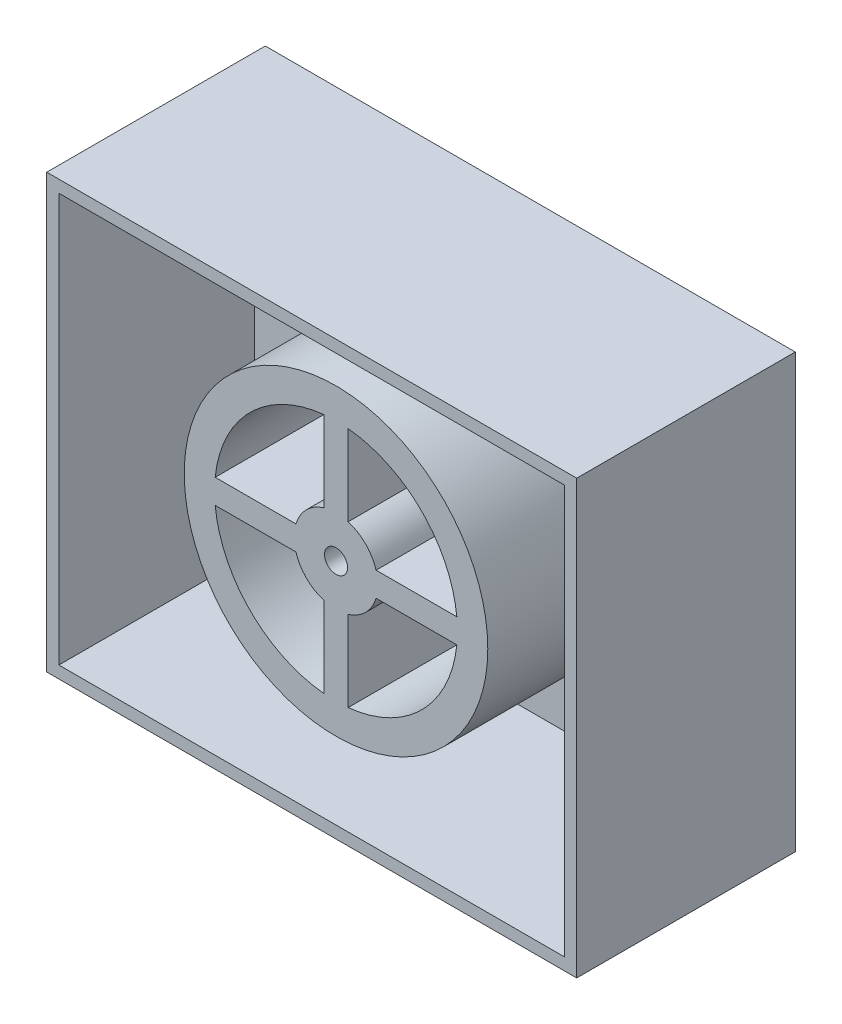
ISO-10303-21;
HEADER;
FILE_DESCRIPTION(('STEP AP214'),'2;1');
FILE_NAME('part.step','',(''),(''),'','','');
FILE_SCHEMA(('AUTOMOTIVE_DESIGN { 1 0 10303 214 1 1 1 1 }'));
ENDSEC;
DATA;
#1=APPLICATION_CONTEXT('core data for automotive mechanical design processes');
#2=APPLICATION_PROTOCOL_DEFINITION('international standard','automotive_design',2000,#1);
#3=PRODUCT_CONTEXT('',#1,'mechanical');
#4=PRODUCT('Part','Part','',(#3));
#5=PRODUCT_RELATED_PRODUCT_CATEGORY('part','',(#4));
#6=PRODUCT_DEFINITION_FORMATION('','',#4);
#7=PRODUCT_DEFINITION_CONTEXT('part definition',#1,'design');
#8=PRODUCT_DEFINITION('design','',#6,#7);
#9=PRODUCT_DEFINITION_SHAPE('','',#8);
#10=(LENGTH_UNIT() NAMED_UNIT(*) SI_UNIT(.MILLI.,.METRE.));
#11=(NAMED_UNIT(*) PLANE_ANGLE_UNIT() SI_UNIT($,.RADIAN.));
#12=(NAMED_UNIT(*) SI_UNIT($,.STERADIAN.) SOLID_ANGLE_UNIT());
#13=UNCERTAINTY_MEASURE_WITH_UNIT(LENGTH_MEASURE(1.E-05),#10,'distance_accuracy_value','');
#14=(GEOMETRIC_REPRESENTATION_CONTEXT(3) GLOBAL_UNCERTAINTY_ASSIGNED_CONTEXT((#13)) GLOBAL_UNIT_ASSIGNED_CONTEXT((#10,
#11,#12)) REPRESENTATION_CONTEXT('',''));
#15=CARTESIAN_POINT('',(0.,0.,0.));
#16=DIRECTION('',(0.,0.,1.));
#17=DIRECTION('',(1.,0.,0.));
#18=AXIS2_PLACEMENT_3D('',#15,#16,#17);
#19=CARTESIAN_POINT('',(0.,0.,0.));
#20=DIRECTION('',(0.,0.,1.));
#21=DIRECTION('',(1.,0.,0.));
#22=AXIS2_PLACEMENT_3D('',#19,#20,#21);
#23=PLANE('',#22);
#24=CARTESIAN_POINT('',(-10.1860016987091,5.21582887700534,0.));
#25=DIRECTION('',(0.,0.,1.));
#26=DIRECTION('',(1.,0.,0.));
#27=AXIS2_PLACEMENT_3D('',#24,#25,#26);
#28=CIRCLE('',#27,25.);
#29=CARTESIAN_POINT('',(14.8139983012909,5.21582887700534,0.));
#30=VERTEX_POINT('',#29);
#31=EDGE_CURVE('E62',#30,#30,#28,.T.);
#32=ORIENTED_EDGE('',*,*,#31,.F.);
#33=EDGE_LOOP('',(#32));
#34=FACE_BOUND('',#33,.T.);
#35=DIRECTION('',(-1.,0.,0.));
#36=VECTOR('',#35,1.);
#37=CARTESIAN_POINT('',(28.2619337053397,35.6684077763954,0.));
#38=LINE('',#37,#36);
#39=CARTESIAN_POINT('',(28.2619337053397,35.6684077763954,0.));
#40=VERTEX_POINT('',#39);
#41=CARTESIAN_POINT('',(-48.6339371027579,35.6684077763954,0.));
#42=VERTEX_POINT('',#41);
#43=EDGE_CURVE('E270',#40,#42,#38,.T.);
#44=ORIENTED_EDGE('',*,*,#43,.T.);
#45=DIRECTION('',(0.,-1.,0.));
#46=VECTOR('',#45,1.);
#47=CARTESIAN_POINT('',(-48.6339371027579,35.6684077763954,0.));
#48=LINE('',#47,#46);
#49=CARTESIAN_POINT('',(-48.6339371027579,-25.2367500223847,0.));
#50=VERTEX_POINT('',#49);
#51=EDGE_CURVE('E277',#42,#50,#48,.T.);
#52=ORIENTED_EDGE('',*,*,#51,.T.);
#53=DIRECTION('',(1.,0.,0.));
#54=VECTOR('',#53,1.);
#55=CARTESIAN_POINT('',(-48.6339371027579,-25.2367500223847,0.));
#56=LINE('',#55,#54);
#57=CARTESIAN_POINT('',(28.2619337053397,-25.2367500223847,0.));
#58=VERTEX_POINT('',#57);
#59=EDGE_CURVE('E250',#50,#58,#56,.T.);
#60=ORIENTED_EDGE('',*,*,#59,.T.);
#61=DIRECTION('',(0.,1.,0.));
#62=VECTOR('',#61,1.);
#63=CARTESIAN_POINT('',(28.2619337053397,-25.2367500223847,0.));
#64=LINE('',#63,#62);
#65=EDGE_CURVE('E74',#58,#40,#64,.T.);
#66=ORIENTED_EDGE('',*,*,#65,.T.);
#67=EDGE_LOOP('',(#44,#52,#60,#66));
#68=FACE_BOUND('',#67,.T.);
#69=ADVANCED_FACE('F58',(#34,#68),#23,.T.);
#70=CARTESIAN_POINT('',(-10.1860016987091,5.21582887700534,25.));
#71=DIRECTION('',(0.,0.,1.));
#72=DIRECTION('',(1.,0.,0.));
#73=AXIS2_PLACEMENT_3D('',#70,#71,#72);
#74=PLANE('',#73);
#75=CARTESIAN_POINT('',(-10.1860016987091,5.21582887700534,25.));
#76=DIRECTION('',(0.,0.,1.));
#77=DIRECTION('',(1.,0.,0.));
#78=AXIS2_PLACEMENT_3D('',#75,#76,#77);
#79=CIRCLE('',#78,25.);
#80=CARTESIAN_POINT('',(14.8139983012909,5.21582887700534,25.));
#81=VERTEX_POINT('',#80);
#82=EDGE_CURVE('E12',#81,#81,#79,.T.);
#83=ORIENTED_EDGE('',*,*,#82,.T.);
#84=EDGE_LOOP('',(#83));
#85=FACE_BOUND('',#84,.T.);
#86=CARTESIAN_POINT('',(-10.1860016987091,5.21582887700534,25.));
#87=DIRECTION('',(0.,0.,1.));
#88=DIRECTION('',(1.,0.,0.));
#89=AXIS2_PLACEMENT_3D('',#86,#87,#88);
#90=CIRCLE('',#89,1.9);
#91=CARTESIAN_POINT('',(-8.28600169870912,5.21582887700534,25.));
#92=VERTEX_POINT('',#91);
#93=EDGE_CURVE('E67',#92,#92,#90,.T.);
#94=ORIENTED_EDGE('',*,*,#93,.F.);
#95=EDGE_LOOP('',(#94));
#96=FACE_BOUND('',#95,.T.);
#97=DIRECTION('',(1.,0.,0.));
#98=VECTOR('',#97,1.);
#99=CARTESIAN_POINT('',(-3.5822149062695,7.21582887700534,25.));
#100=LINE('',#99,#98);
#101=CARTESIAN_POINT('',(-3.5822149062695,7.21582887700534,25.));
#102=VERTEX_POINT('',#101);
#103=CARTESIAN_POINT('',(9.71374704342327,7.21582887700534,25.));
#104=VERTEX_POINT('',#103);
#105=EDGE_CURVE('E437',#102,#104,#100,.T.);
#106=ORIENTED_EDGE('',*,*,#105,.F.);
#107=CARTESIAN_POINT('',(-10.1860016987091,5.21582887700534,25.));
#108=DIRECTION('',(0.,0.,-1.));
#109=DIRECTION('',(1.,0.,0.));
#110=AXIS2_PLACEMENT_3D('',#107,#108,#109);
#111=CIRCLE('',#110,6.9);
#112=CARTESIAN_POINT('',(-8.18600169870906,11.8196156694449,25.));
#113=VERTEX_POINT('',#112);
#114=EDGE_CURVE('E435',#113,#102,#111,.T.);
#115=ORIENTED_EDGE('',*,*,#114,.F.);
#116=DIRECTION('',(0.,-1.,0.));
#117=VECTOR('',#116,1.);
#118=CARTESIAN_POINT('',(-8.18600169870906,11.8196156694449,25.));
#119=LINE('',#118,#117);
#120=CARTESIAN_POINT('',(-8.18600169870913,25.1155776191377,25.));
#121=VERTEX_POINT('',#120);
#122=EDGE_CURVE('E443',#121,#113,#119,.T.);
#123=ORIENTED_EDGE('',*,*,#122,.F.);
#124=CARTESIAN_POINT('',(-10.1860016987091,5.21582887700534,25.));
#125=DIRECTION('',(0.,0.,1.));
#126=DIRECTION('',(1.,0.,0.));
#127=AXIS2_PLACEMENT_3D('',#124,#125,#126);
#128=CIRCLE('',#127,20.);
#129=EDGE_CURVE('E440',#104,#121,#128,.T.);
#130=ORIENTED_EDGE('',*,*,#129,.F.);
#131=EDGE_LOOP('',(#106,#115,#123,#130));
#132=FACE_BOUND('',#131,.T.);
#133=DIRECTION('',(0.,-1.,0.));
#134=VECTOR('',#133,1.);
#135=CARTESIAN_POINT('',(-8.18600169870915,-1.38795791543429,25.));
#136=LINE('',#135,#134);
#137=CARTESIAN_POINT('',(-8.18600169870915,-1.38795791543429,25.));
#138=VERTEX_POINT('',#137);
#139=CARTESIAN_POINT('',(-8.18600169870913,-14.6839198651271,25.));
#140=VERTEX_POINT('',#139);
#141=EDGE_CURVE('E407',#138,#140,#136,.T.);
#142=ORIENTED_EDGE('',*,*,#141,.F.);
#143=CARTESIAN_POINT('',(-10.1860016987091,5.21582887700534,25.));
#144=DIRECTION('',(0.,0.,-1.));
#145=DIRECTION('',(1.,0.,0.));
#146=AXIS2_PLACEMENT_3D('',#143,#144,#145);
#147=CIRCLE('',#146,6.9);
#148=CARTESIAN_POINT('',(-3.5822149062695,3.21582887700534,25.));
#149=VERTEX_POINT('',#148);
#150=EDGE_CURVE('E405',#149,#138,#147,.T.);
#151=ORIENTED_EDGE('',*,*,#150,.F.);
#152=DIRECTION('',(-1.,0.,0.));
#153=VECTOR('',#152,1.);
#154=CARTESIAN_POINT('',(-3.5822149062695,3.21582887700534,25.));
#155=LINE('',#154,#153);
#156=CARTESIAN_POINT('',(9.71374704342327,3.21582887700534,25.));
#157=VERTEX_POINT('',#156);
#158=EDGE_CURVE('E413',#157,#149,#155,.T.);
#159=ORIENTED_EDGE('',*,*,#158,.F.);
#160=CARTESIAN_POINT('',(-10.1860016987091,5.21582887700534,25.));
#161=DIRECTION('',(0.,0.,1.));
#162=DIRECTION('',(1.,0.,0.));
#163=AXIS2_PLACEMENT_3D('',#160,#161,#162);
#164=CIRCLE('',#163,20.);
#165=EDGE_CURVE('E410',#140,#157,#164,.T.);
#166=ORIENTED_EDGE('',*,*,#165,.F.);
#167=EDGE_LOOP('',(#142,#151,#159,#166));
#168=FACE_BOUND('',#167,.T.);
#169=DIRECTION('',(-1.,0.,0.));
#170=VECTOR('',#169,1.);
#171=CARTESIAN_POINT('',(-16.7897884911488,3.21582887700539,25.));
#172=LINE('',#171,#170);
#173=CARTESIAN_POINT('',(-16.7897884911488,3.21582887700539,25.));
#174=VERTEX_POINT('',#173);
#175=CARTESIAN_POINT('',(-30.0857504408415,3.21582887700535,25.));
#176=VERTEX_POINT('',#175);
#177=EDGE_CURVE('E377',#174,#176,#172,.T.);
#178=ORIENTED_EDGE('',*,*,#177,.F.);
#179=CARTESIAN_POINT('',(-10.1860016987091,5.21582887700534,25.));
#180=DIRECTION('',(0.,0.,-1.));
#181=DIRECTION('',(1.,0.,0.));
#182=AXIS2_PLACEMENT_3D('',#179,#180,#181);
#183=CIRCLE('',#182,6.9);
#184=CARTESIAN_POINT('',(-12.1860016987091,-1.38795791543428,25.));
#185=VERTEX_POINT('',#184);
#186=EDGE_CURVE('E375',#185,#174,#183,.T.);
#187=ORIENTED_EDGE('',*,*,#186,.F.);
#188=DIRECTION('',(0.,1.,0.));
#189=VECTOR('',#188,1.);
#190=CARTESIAN_POINT('',(-12.1860016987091,-1.38795791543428,25.));
#191=LINE('',#190,#189);
#192=CARTESIAN_POINT('',(-12.1860016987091,-14.6839198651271,25.));
#193=VERTEX_POINT('',#192);
#194=EDGE_CURVE('E383',#193,#185,#191,.T.);
#195=ORIENTED_EDGE('',*,*,#194,.F.);
#196=CARTESIAN_POINT('',(-10.1860016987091,5.21582887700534,25.));
#197=DIRECTION('',(0.,0.,1.));
#198=DIRECTION('',(1.,0.,0.));
#199=AXIS2_PLACEMENT_3D('',#196,#197,#198);
#200=CIRCLE('',#199,20.);
#201=EDGE_CURVE('E380',#176,#193,#200,.T.);
#202=ORIENTED_EDGE('',*,*,#201,.F.);
#203=EDGE_LOOP('',(#178,#187,#195,#202));
#204=FACE_BOUND('',#203,.T.);
#205=DIRECTION('',(0.,1.,0.));
#206=VECTOR('',#205,1.);
#207=CARTESIAN_POINT('',(-12.1860016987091,11.819615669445,25.));
#208=LINE('',#207,#206);
#209=CARTESIAN_POINT('',(-12.1860016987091,11.819615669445,25.));
#210=VERTEX_POINT('',#209);
#211=CARTESIAN_POINT('',(-12.1860016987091,25.1155776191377,25.));
#212=VERTEX_POINT('',#211);
#213=EDGE_CURVE('E348',#210,#212,#208,.T.);
#214=ORIENTED_EDGE('',*,*,#213,.F.);
#215=CARTESIAN_POINT('',(-10.1860016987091,5.21582887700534,25.));
#216=DIRECTION('',(0.,0.,-1.));
#217=DIRECTION('',(1.,0.,0.));
#218=AXIS2_PLACEMENT_3D('',#215,#216,#217);
#219=CIRCLE('',#218,6.9);
#220=CARTESIAN_POINT('',(-16.7897884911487,7.21582887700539,25.));
#221=VERTEX_POINT('',#220);
#222=EDGE_CURVE('E346',#221,#210,#219,.T.);
#223=ORIENTED_EDGE('',*,*,#222,.F.);
#224=DIRECTION('',(1.,0.,0.));
#225=VECTOR('',#224,1.);
#226=CARTESIAN_POINT('',(-16.7897884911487,7.21582887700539,25.));
#227=LINE('',#226,#225);
#228=CARTESIAN_POINT('',(-30.0857504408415,7.21582887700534,25.));
#229=VERTEX_POINT('',#228);
#230=EDGE_CURVE('E353',#229,#221,#227,.T.);
#231=ORIENTED_EDGE('',*,*,#230,.F.);
#232=CARTESIAN_POINT('',(-10.1860016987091,5.21582887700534,25.));
#233=DIRECTION('',(0.,0.,1.));
#234=DIRECTION('',(1.,0.,0.));
#235=AXIS2_PLACEMENT_3D('',#232,#233,#234);
#236=CIRCLE('',#235,20.);
#237=EDGE_CURVE('E351',#212,#229,#236,.T.);
#238=ORIENTED_EDGE('',*,*,#237,.F.);
#239=EDGE_LOOP('',(#214,#223,#231,#238));
#240=FACE_BOUND('',#239,.T.);
#241=ADVANCED_FACE('F484',(#85,#96,#132,#168,#204,#240),#74,.T.);
#242=CARTESIAN_POINT('',(-10.1860016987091,5.21582887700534,25.));
#243=DIRECTION('',(0.,0.,-1.));
#244=DIRECTION('',(-1.,0.,0.));
#245=AXIS2_PLACEMENT_3D('',#242,#243,#244);
#246=CYLINDRICAL_SURFACE('',#245,25.);
#247=ORIENTED_EDGE('',*,*,#82,.F.);
#248=EDGE_LOOP('',(#247));
#249=FACE_BOUND('',#248,.T.);
#250=ORIENTED_EDGE('',*,*,#31,.T.);
#251=EDGE_LOOP('',(#250));
#252=FACE_BOUND('',#251,.T.);
#253=ADVANCED_FACE('F60',(#249,#252),#246,.T.);
#254=CARTESIAN_POINT('',(-10.1860016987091,5.21582887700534,25.));
#255=DIRECTION('',(0.,0.,-1.));
#256=DIRECTION('',(-1.,0.,0.));
#257=AXIS2_PLACEMENT_3D('',#254,#255,#256);
#258=CYLINDRICAL_SURFACE('',#257,1.9);
#259=ORIENTED_EDGE('',*,*,#93,.T.);
#260=EDGE_LOOP('',(#259));
#261=FACE_BOUND('',#260,.T.);
#262=CARTESIAN_POINT('',(-10.1860016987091,5.21582887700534,0.));
#263=DIRECTION('',(0.,0.,1.));
#264=DIRECTION('',(1.,0.,0.));
#265=AXIS2_PLACEMENT_3D('',#262,#263,#264);
#266=CIRCLE('',#265,1.9);
#267=CARTESIAN_POINT('',(-8.28600169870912,5.21582887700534,0.));
#268=VERTEX_POINT('',#267);
#269=EDGE_CURVE('E464',#268,#268,#266,.T.);
#270=ORIENTED_EDGE('',*,*,#269,.F.);
#271=EDGE_LOOP('',(#270));
#272=FACE_BOUND('',#271,.T.);
#273=ADVANCED_FACE('F472',(#261,#272),#258,.F.);
#274=CARTESIAN_POINT('',(-10.1860016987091,5.21582887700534,25.));
#275=DIRECTION('',(0.,0.,-1.));
#276=DIRECTION('',(-1.,0.,0.));
#277=AXIS2_PLACEMENT_3D('',#274,#275,#276);
#278=CYLINDRICAL_SURFACE('',#277,6.9);
#279=CARTESIAN_POINT('',(-10.1860016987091,5.21582887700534,0.));
#280=DIRECTION('',(0.,0.,-1.));
#281=DIRECTION('',(1.,0.,0.));
#282=AXIS2_PLACEMENT_3D('',#279,#280,#281);
#283=CIRCLE('',#282,6.9);
#284=CARTESIAN_POINT('',(-8.18600169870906,11.8196156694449,0.));
#285=VERTEX_POINT('',#284);
#286=CARTESIAN_POINT('',(-3.5822149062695,7.21582887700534,0.));
#287=VERTEX_POINT('',#286);
#288=EDGE_CURVE('E434',#285,#287,#283,.T.);
#289=ORIENTED_EDGE('',*,*,#288,.F.);
#290=DIRECTION('',(0.,0.,-1.));
#291=VECTOR('',#290,1.);
#292=CARTESIAN_POINT('',(-8.18600169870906,11.8196156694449,25.));
#293=LINE('',#292,#291);
#294=EDGE_CURVE('E445',#113,#285,#293,.T.);
#295=ORIENTED_EDGE('',*,*,#294,.F.);
#296=ORIENTED_EDGE('',*,*,#114,.T.);
#297=DIRECTION('',(0.,0.,-1.));
#298=VECTOR('',#297,1.);
#299=CARTESIAN_POINT('',(-3.5822149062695,7.21582887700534,25.));
#300=LINE('',#299,#298);
#301=EDGE_CURVE('E461',#102,#287,#300,.T.);
#302=ORIENTED_EDGE('',*,*,#301,.T.);
#303=EDGE_LOOP('',(#289,#295,#296,#302));
#304=FACE_BOUND('',#303,.T.);
#305=ADVANCED_FACE('F474',(#304),#278,.T.);
#306=CARTESIAN_POINT('',(-3.5822149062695,7.21582887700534,25.));
#307=DIRECTION('',(0.,1.,0.));
#308=DIRECTION('',(0.,0.,1.));
#309=AXIS2_PLACEMENT_3D('',#306,#307,#308);
#310=PLANE('',#309);
#311=DIRECTION('',(1.,0.,0.));
#312=VECTOR('',#311,1.);
#313=CARTESIAN_POINT('',(-3.5822149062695,7.21582887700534,0.));
#314=LINE('',#313,#312);
#315=CARTESIAN_POINT('',(9.71374704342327,7.21582887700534,0.));
#316=VERTEX_POINT('',#315);
#317=EDGE_CURVE('E448',#287,#316,#314,.T.);
#318=ORIENTED_EDGE('',*,*,#317,.F.);
#319=ORIENTED_EDGE('',*,*,#301,.F.);
#320=ORIENTED_EDGE('',*,*,#105,.T.);
#321=DIRECTION('',(0.,0.,-1.));
#322=VECTOR('',#321,1.);
#323=CARTESIAN_POINT('',(9.71374704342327,7.21582887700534,25.));
#324=LINE('',#323,#322);
#325=EDGE_CURVE('E459',#104,#316,#324,.T.);
#326=ORIENTED_EDGE('',*,*,#325,.T.);
#327=EDGE_LOOP('',(#318,#319,#320,#326));
#328=FACE_BOUND('',#327,.T.);
#329=ADVANCED_FACE('F481',(#328),#310,.T.);
#330=CARTESIAN_POINT('',(-10.1860016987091,5.21582887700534,25.));
#331=DIRECTION('',(0.,0.,-1.));
#332=DIRECTION('',(-1.,0.,0.));
#333=AXIS2_PLACEMENT_3D('',#330,#331,#332);
#334=CYLINDRICAL_SURFACE('',#333,20.);
#335=CARTESIAN_POINT('',(-10.1860016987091,5.21582887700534,0.));
#336=DIRECTION('',(0.,0.,1.));
#337=DIRECTION('',(1.,0.,0.));
#338=AXIS2_PLACEMENT_3D('',#335,#336,#337);
#339=CIRCLE('',#338,20.);
#340=CARTESIAN_POINT('',(-8.18600169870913,25.1155776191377,0.));
#341=VERTEX_POINT('',#340);
#342=EDGE_CURVE('E451',#316,#341,#339,.T.);
#343=ORIENTED_EDGE('',*,*,#342,.F.);
#344=ORIENTED_EDGE('',*,*,#325,.F.);
#345=ORIENTED_EDGE('',*,*,#129,.T.);
#346=DIRECTION('',(0.,0.,-1.));
#347=VECTOR('',#346,1.);
#348=CARTESIAN_POINT('',(-8.18600169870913,25.1155776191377,25.));
#349=LINE('',#348,#347);
#350=EDGE_CURVE('E457',#121,#341,#349,.T.);
#351=ORIENTED_EDGE('',*,*,#350,.T.);
#352=EDGE_LOOP('',(#343,#344,#345,#351));
#353=FACE_BOUND('',#352,.T.);
#354=ADVANCED_FACE('F573',(#353),#334,.F.);
#355=CARTESIAN_POINT('',(-8.18600169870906,11.8196156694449,25.));
#356=DIRECTION('',(1.,0.,0.));
#357=DIRECTION('',(0.,1.,0.));
#358=AXIS2_PLACEMENT_3D('',#355,#356,#357);
#359=PLANE('',#358);
#360=DIRECTION('',(0.,-1.,0.));
#361=VECTOR('',#360,1.);
#362=CARTESIAN_POINT('',(-8.18600169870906,11.8196156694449,0.));
#363=LINE('',#362,#361);
#364=EDGE_CURVE('E438',#341,#285,#363,.T.);
#365=ORIENTED_EDGE('',*,*,#364,.F.);
#366=ORIENTED_EDGE('',*,*,#350,.F.);
#367=ORIENTED_EDGE('',*,*,#122,.T.);
#368=ORIENTED_EDGE('',*,*,#294,.T.);
#369=EDGE_LOOP('',(#365,#366,#367,#368));
#370=FACE_BOUND('',#369,.T.);
#371=ADVANCED_FACE('F569',(#370),#359,.T.);
#372=CARTESIAN_POINT('',(-10.1860016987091,5.21582887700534,25.));
#373=DIRECTION('',(0.,0.,-1.));
#374=DIRECTION('',(-1.,0.,0.));
#375=AXIS2_PLACEMENT_3D('',#372,#373,#374);
#376=CYLINDRICAL_SURFACE('',#375,6.9);
#377=CARTESIAN_POINT('',(-10.1860016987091,5.21582887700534,0.));
#378=DIRECTION('',(0.,0.,-1.));
#379=DIRECTION('',(1.,0.,0.));
#380=AXIS2_PLACEMENT_3D('',#377,#378,#379);
#381=CIRCLE('',#380,6.9);
#382=CARTESIAN_POINT('',(-3.5822149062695,3.21582887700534,0.));
#383=VERTEX_POINT('',#382);
#384=CARTESIAN_POINT('',(-8.18600169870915,-1.38795791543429,0.));
#385=VERTEX_POINT('',#384);
#386=EDGE_CURVE('E404',#383,#385,#381,.T.);
#387=ORIENTED_EDGE('',*,*,#386,.F.);
#388=DIRECTION('',(0.,0.,-1.));
#389=VECTOR('',#388,1.);
#390=CARTESIAN_POINT('',(-3.5822149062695,3.21582887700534,25.));
#391=LINE('',#390,#389);
#392=EDGE_CURVE('E415',#149,#383,#391,.T.);
#393=ORIENTED_EDGE('',*,*,#392,.F.);
#394=ORIENTED_EDGE('',*,*,#150,.T.);
#395=DIRECTION('',(0.,0.,-1.));
#396=VECTOR('',#395,1.);
#397=CARTESIAN_POINT('',(-8.18600169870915,-1.38795791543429,25.));
#398=LINE('',#397,#396);
#399=EDGE_CURVE('E431',#138,#385,#398,.T.);
#400=ORIENTED_EDGE('',*,*,#399,.T.);
#401=EDGE_LOOP('',(#387,#393,#394,#400));
#402=FACE_BOUND('',#401,.T.);
#403=ADVANCED_FACE('F565',(#402),#376,.T.);
#404=CARTESIAN_POINT('',(-8.18600169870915,-1.38795791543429,25.));
#405=DIRECTION('',(1.,0.,0.));
#406=DIRECTION('',(0.,1.,0.));
#407=AXIS2_PLACEMENT_3D('',#404,#405,#406);
#408=PLANE('',#407);
#409=DIRECTION('',(0.,-1.,0.));
#410=VECTOR('',#409,1.);
#411=CARTESIAN_POINT('',(-8.18600169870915,-1.38795791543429,0.));
#412=LINE('',#411,#410);
#413=CARTESIAN_POINT('',(-8.18600169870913,-14.6839198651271,0.));
#414=VERTEX_POINT('',#413);
#415=EDGE_CURVE('E418',#385,#414,#412,.T.);
#416=ORIENTED_EDGE('',*,*,#415,.F.);
#417=ORIENTED_EDGE('',*,*,#399,.F.);
#418=ORIENTED_EDGE('',*,*,#141,.T.);
#419=DIRECTION('',(0.,0.,-1.));
#420=VECTOR('',#419,1.);
#421=CARTESIAN_POINT('',(-8.18600169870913,-14.6839198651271,25.));
#422=LINE('',#421,#420);
#423=EDGE_CURVE('E429',#140,#414,#422,.T.);
#424=ORIENTED_EDGE('',*,*,#423,.T.);
#425=EDGE_LOOP('',(#416,#417,#418,#424));
#426=FACE_BOUND('',#425,.T.);
#427=ADVANCED_FACE('F561',(#426),#408,.T.);
#428=CARTESIAN_POINT('',(-10.1860016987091,5.21582887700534,25.));
#429=DIRECTION('',(0.,0.,-1.));
#430=DIRECTION('',(-1.,0.,0.));
#431=AXIS2_PLACEMENT_3D('',#428,#429,#430);
#432=CYLINDRICAL_SURFACE('',#431,20.);
#433=CARTESIAN_POINT('',(-10.1860016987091,5.21582887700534,0.));
#434=DIRECTION('',(0.,0.,1.));
#435=DIRECTION('',(1.,0.,0.));
#436=AXIS2_PLACEMENT_3D('',#433,#434,#435);
#437=CIRCLE('',#436,20.);
#438=CARTESIAN_POINT('',(9.71374704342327,3.21582887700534,0.));
#439=VERTEX_POINT('',#438);
#440=EDGE_CURVE('E421',#414,#439,#437,.T.);
#441=ORIENTED_EDGE('',*,*,#440,.F.);
#442=ORIENTED_EDGE('',*,*,#423,.F.);
#443=ORIENTED_EDGE('',*,*,#165,.T.);
#444=DIRECTION('',(0.,0.,-1.));
#445=VECTOR('',#444,1.);
#446=CARTESIAN_POINT('',(9.71374704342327,3.21582887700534,25.));
#447=LINE('',#446,#445);
#448=EDGE_CURVE('E427',#157,#439,#447,.T.);
#449=ORIENTED_EDGE('',*,*,#448,.T.);
#450=EDGE_LOOP('',(#441,#442,#443,#449));
#451=FACE_BOUND('',#450,.T.);
#452=ADVANCED_FACE('F557',(#451),#432,.F.);
#453=CARTESIAN_POINT('',(-3.5822149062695,3.21582887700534,25.));
#454=DIRECTION('',(0.,-1.,0.));
#455=DIRECTION('',(0.,0.,-1.));
#456=AXIS2_PLACEMENT_3D('',#453,#454,#455);
#457=PLANE('',#456);
#458=DIRECTION('',(-1.,0.,0.));
#459=VECTOR('',#458,1.);
#460=CARTESIAN_POINT('',(-3.5822149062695,3.21582887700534,0.));
#461=LINE('',#460,#459);
#462=EDGE_CURVE('E408',#439,#383,#461,.T.);
#463=ORIENTED_EDGE('',*,*,#462,.F.);
#464=ORIENTED_EDGE('',*,*,#448,.F.);
#465=ORIENTED_EDGE('',*,*,#158,.T.);
#466=ORIENTED_EDGE('',*,*,#392,.T.);
#467=EDGE_LOOP('',(#463,#464,#465,#466));
#468=FACE_BOUND('',#467,.T.);
#469=ADVANCED_FACE('F553',(#468),#457,.T.);
#470=CARTESIAN_POINT('',(-10.1860016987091,5.21582887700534,25.));
#471=DIRECTION('',(0.,0.,-1.));
#472=DIRECTION('',(-1.,0.,0.));
#473=AXIS2_PLACEMENT_3D('',#470,#471,#472);
#474=CYLINDRICAL_SURFACE('',#473,6.9);
#475=CARTESIAN_POINT('',(-10.1860016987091,5.21582887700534,0.));
#476=DIRECTION('',(0.,0.,-1.));
#477=DIRECTION('',(1.,0.,0.));
#478=AXIS2_PLACEMENT_3D('',#475,#476,#477);
#479=CIRCLE('',#478,6.9);
#480=CARTESIAN_POINT('',(-12.1860016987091,-1.38795791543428,0.));
#481=VERTEX_POINT('',#480);
#482=CARTESIAN_POINT('',(-16.7897884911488,3.21582887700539,0.));
#483=VERTEX_POINT('',#482);
#484=EDGE_CURVE('E374',#481,#483,#479,.T.);
#485=ORIENTED_EDGE('',*,*,#484,.F.);
#486=DIRECTION('',(0.,0.,-1.));
#487=VECTOR('',#486,1.);
#488=CARTESIAN_POINT('',(-12.1860016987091,-1.38795791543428,25.));
#489=LINE('',#488,#487);
#490=EDGE_CURVE('E385',#185,#481,#489,.T.);
#491=ORIENTED_EDGE('',*,*,#490,.F.);
#492=ORIENTED_EDGE('',*,*,#186,.T.);
#493=DIRECTION('',(0.,0.,-1.));
#494=VECTOR('',#493,1.);
#495=CARTESIAN_POINT('',(-16.7897884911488,3.21582887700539,25.));
#496=LINE('',#495,#494);
#497=EDGE_CURVE('E401',#174,#483,#496,.T.);
#498=ORIENTED_EDGE('',*,*,#497,.T.);
#499=EDGE_LOOP('',(#485,#491,#492,#498));
#500=FACE_BOUND('',#499,.T.);
#501=ADVANCED_FACE('F549',(#500),#474,.T.);
#502=CARTESIAN_POINT('',(-16.7897884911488,3.21582887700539,25.));
#503=DIRECTION('',(0.,-1.,0.));
#504=DIRECTION('',(1.,0.,0.));
#505=AXIS2_PLACEMENT_3D('',#502,#503,#504);
#506=PLANE('',#505);
#507=DIRECTION('',(-1.,0.,0.));
#508=VECTOR('',#507,1.);
#509=CARTESIAN_POINT('',(-16.7897884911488,3.21582887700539,0.));
#510=LINE('',#509,#508);
#511=CARTESIAN_POINT('',(-30.0857504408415,3.21582887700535,0.));
#512=VERTEX_POINT('',#511);
#513=EDGE_CURVE('E388',#483,#512,#510,.T.);
#514=ORIENTED_EDGE('',*,*,#513,.F.);
#515=ORIENTED_EDGE('',*,*,#497,.F.);
#516=ORIENTED_EDGE('',*,*,#177,.T.);
#517=DIRECTION('',(0.,0.,-1.));
#518=VECTOR('',#517,1.);
#519=CARTESIAN_POINT('',(-30.0857504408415,3.21582887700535,25.));
#520=LINE('',#519,#518);
#521=EDGE_CURVE('E399',#176,#512,#520,.T.);
#522=ORIENTED_EDGE('',*,*,#521,.T.);
#523=EDGE_LOOP('',(#514,#515,#516,#522));
#524=FACE_BOUND('',#523,.T.);
#525=ADVANCED_FACE('F545',(#524),#506,.T.);
#526=CARTESIAN_POINT('',(-10.1860016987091,5.21582887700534,25.));
#527=DIRECTION('',(0.,0.,-1.));
#528=DIRECTION('',(-1.,0.,0.));
#529=AXIS2_PLACEMENT_3D('',#526,#527,#528);
#530=CYLINDRICAL_SURFACE('',#529,20.);
#531=CARTESIAN_POINT('',(-10.1860016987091,5.21582887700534,0.));
#532=DIRECTION('',(0.,0.,1.));
#533=DIRECTION('',(1.,0.,0.));
#534=AXIS2_PLACEMENT_3D('',#531,#532,#533);
#535=CIRCLE('',#534,20.);
#536=CARTESIAN_POINT('',(-12.1860016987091,-14.6839198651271,0.));
#537=VERTEX_POINT('',#536);
#538=EDGE_CURVE('E391',#512,#537,#535,.T.);
#539=ORIENTED_EDGE('',*,*,#538,.F.);
#540=ORIENTED_EDGE('',*,*,#521,.F.);
#541=ORIENTED_EDGE('',*,*,#201,.T.);
#542=DIRECTION('',(0.,0.,-1.));
#543=VECTOR('',#542,1.);
#544=CARTESIAN_POINT('',(-12.1860016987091,-14.6839198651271,25.));
#545=LINE('',#544,#543);
#546=EDGE_CURVE('E397',#193,#537,#545,.T.);
#547=ORIENTED_EDGE('',*,*,#546,.T.);
#548=EDGE_LOOP('',(#539,#540,#541,#547));
#549=FACE_BOUND('',#548,.T.);
#550=ADVANCED_FACE('F541',(#549),#530,.F.);
#551=CARTESIAN_POINT('',(-12.1860016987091,-1.38795791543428,25.));
#552=DIRECTION('',(-1.,0.,0.));
#553=DIRECTION('',(0.,-1.,0.));
#554=AXIS2_PLACEMENT_3D('',#551,#552,#553);
#555=PLANE('',#554);
#556=DIRECTION('',(0.,1.,0.));
#557=VECTOR('',#556,1.);
#558=CARTESIAN_POINT('',(-12.1860016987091,-1.38795791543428,0.));
#559=LINE('',#558,#557);
#560=EDGE_CURVE('E378',#537,#481,#559,.T.);
#561=ORIENTED_EDGE('',*,*,#560,.F.);
#562=ORIENTED_EDGE('',*,*,#546,.F.);
#563=ORIENTED_EDGE('',*,*,#194,.T.);
#564=ORIENTED_EDGE('',*,*,#490,.T.);
#565=EDGE_LOOP('',(#561,#562,#563,#564));
#566=FACE_BOUND('',#565,.T.);
#567=ADVANCED_FACE('F538',(#566),#555,.T.);
#568=CARTESIAN_POINT('',(-10.1860016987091,5.21582887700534,25.));
#569=DIRECTION('',(0.,0.,-1.));
#570=DIRECTION('',(-1.,0.,0.));
#571=AXIS2_PLACEMENT_3D('',#568,#569,#570);
#572=CYLINDRICAL_SURFACE('',#571,6.9);
#573=CARTESIAN_POINT('',(-10.1860016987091,5.21582887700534,0.));
#574=DIRECTION('',(0.,0.,-1.));
#575=DIRECTION('',(1.,0.,0.));
#576=AXIS2_PLACEMENT_3D('',#573,#574,#575);
#577=CIRCLE('',#576,6.9);
#578=CARTESIAN_POINT('',(-16.7897884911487,7.21582887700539,0.));
#579=VERTEX_POINT('',#578);
#580=CARTESIAN_POINT('',(-12.1860016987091,11.819615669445,0.));
#581=VERTEX_POINT('',#580);
#582=EDGE_CURVE('E356',#579,#581,#577,.T.);
#583=ORIENTED_EDGE('',*,*,#582,.F.);
#584=DIRECTION('',(0.,0.,-1.));
#585=VECTOR('',#584,1.);
#586=CARTESIAN_POINT('',(-16.7897884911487,7.21582887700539,25.));
#587=LINE('',#586,#585);
#588=EDGE_CURVE('E355',#221,#579,#587,.T.);
#589=ORIENTED_EDGE('',*,*,#588,.F.);
#590=ORIENTED_EDGE('',*,*,#222,.T.);
#591=DIRECTION('',(0.,0.,-1.));
#592=VECTOR('',#591,1.);
#593=CARTESIAN_POINT('',(-12.1860016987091,11.819615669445,25.));
#594=LINE('',#593,#592);
#595=EDGE_CURVE('E371',#210,#581,#594,.T.);
#596=ORIENTED_EDGE('',*,*,#595,.T.);
#597=EDGE_LOOP('',(#583,#589,#590,#596));
#598=FACE_BOUND('',#597,.T.);
#599=ADVANCED_FACE('F519',(#598),#572,.T.);
#600=CARTESIAN_POINT('',(-12.1860016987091,11.819615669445,25.));
#601=DIRECTION('',(-1.,0.,0.));
#602=DIRECTION('',(0.,-1.,0.));
#603=AXIS2_PLACEMENT_3D('',#600,#601,#602);
#604=PLANE('',#603);
#605=DIRECTION('',(0.,1.,0.));
#606=VECTOR('',#605,1.);
#607=CARTESIAN_POINT('',(-12.1860016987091,11.819615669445,0.));
#608=LINE('',#607,#606);
#609=CARTESIAN_POINT('',(-12.1860016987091,25.1155776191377,0.));
#610=VERTEX_POINT('',#609);
#611=EDGE_CURVE('E359',#581,#610,#608,.T.);
#612=ORIENTED_EDGE('',*,*,#611,.F.);
#613=ORIENTED_EDGE('',*,*,#595,.F.);
#614=ORIENTED_EDGE('',*,*,#213,.T.);
#615=DIRECTION('',(0.,0.,-1.));
#616=VECTOR('',#615,1.);
#617=CARTESIAN_POINT('',(-12.1860016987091,25.1155776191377,25.));
#618=LINE('',#617,#616);
#619=EDGE_CURVE('E369',#212,#610,#618,.T.);
#620=ORIENTED_EDGE('',*,*,#619,.T.);
#621=EDGE_LOOP('',(#612,#613,#614,#620));
#622=FACE_BOUND('',#621,.T.);
#623=ADVANCED_FACE('F523',(#622),#604,.T.);
#624=CARTESIAN_POINT('',(-10.1860016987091,5.21582887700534,25.));
#625=DIRECTION('',(0.,0.,-1.));
#626=DIRECTION('',(-1.,0.,0.));
#627=AXIS2_PLACEMENT_3D('',#624,#625,#626);
#628=CYLINDRICAL_SURFACE('',#627,20.);
#629=CARTESIAN_POINT('',(-10.1860016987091,5.21582887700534,0.));
#630=DIRECTION('',(0.,0.,1.));
#631=DIRECTION('',(1.,0.,0.));
#632=AXIS2_PLACEMENT_3D('',#629,#630,#631);
#633=CIRCLE('',#632,20.);
#634=CARTESIAN_POINT('',(-30.0857504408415,7.21582887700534,0.));
#635=VERTEX_POINT('',#634);
#636=EDGE_CURVE('E362',#610,#635,#633,.T.);
#637=ORIENTED_EDGE('',*,*,#636,.F.);
#638=ORIENTED_EDGE('',*,*,#619,.F.);
#639=ORIENTED_EDGE('',*,*,#237,.T.);
#640=DIRECTION('',(0.,0.,-1.));
#641=VECTOR('',#640,1.);
#642=CARTESIAN_POINT('',(-30.0857504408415,7.21582887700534,25.));
#643=LINE('',#642,#641);
#644=EDGE_CURVE('E82',#229,#635,#643,.T.);
#645=ORIENTED_EDGE('',*,*,#644,.T.);
#646=EDGE_LOOP('',(#637,#638,#639,#645));
#647=FACE_BOUND('',#646,.T.);
#648=ADVANCED_FACE('F511',(#647),#628,.F.);
#649=CARTESIAN_POINT('',(-16.7897884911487,7.21582887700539,25.));
#650=DIRECTION('',(0.,1.,0.));
#651=DIRECTION('',(-1.,0.,0.));
#652=AXIS2_PLACEMENT_3D('',#649,#650,#651);
#653=PLANE('',#652);
#654=DIRECTION('',(1.,0.,0.));
#655=VECTOR('',#654,1.);
#656=CARTESIAN_POINT('',(-16.7897884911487,7.21582887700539,0.));
#657=LINE('',#656,#655);
#658=EDGE_CURVE('E349',#635,#579,#657,.T.);
#659=ORIENTED_EDGE('',*,*,#658,.F.);
#660=ORIENTED_EDGE('',*,*,#644,.F.);
#661=ORIENTED_EDGE('',*,*,#230,.T.);
#662=ORIENTED_EDGE('',*,*,#588,.T.);
#663=EDGE_LOOP('',(#659,#660,#661,#662));
#664=FACE_BOUND('',#663,.T.);
#665=ADVANCED_FACE('F504',(#664),#653,.T.);
#666=ORIENTED_EDGE('',*,*,#658,.T.);
#667=ORIENTED_EDGE('',*,*,#582,.T.);
#668=ORIENTED_EDGE('',*,*,#611,.T.);
#669=ORIENTED_EDGE('',*,*,#636,.T.);
#670=EDGE_LOOP('',(#666,#667,#668,#669));
#671=FACE_BOUND('',#670,.T.);
#672=ADVANCED_FACE('F490',(#671),#23,.T.);
#673=ORIENTED_EDGE('',*,*,#462,.T.);
#674=ORIENTED_EDGE('',*,*,#386,.T.);
#675=ORIENTED_EDGE('',*,*,#415,.T.);
#676=ORIENTED_EDGE('',*,*,#440,.T.);
#677=EDGE_LOOP('',(#673,#674,#675,#676));
#678=FACE_BOUND('',#677,.T.);
#679=ADVANCED_FACE('F503',(#678),#23,.T.);
#680=ORIENTED_EDGE('',*,*,#269,.T.);
#681=EDGE_LOOP('',(#680));
#682=FACE_BOUND('',#681,.T.);
#683=ADVANCED_FACE('F470',(#682),#23,.T.);
#684=ORIENTED_EDGE('',*,*,#364,.T.);
#685=ORIENTED_EDGE('',*,*,#288,.T.);
#686=ORIENTED_EDGE('',*,*,#317,.T.);
#687=ORIENTED_EDGE('',*,*,#342,.T.);
#688=EDGE_LOOP('',(#684,#685,#686,#687));
#689=FACE_BOUND('',#688,.T.);
#690=ADVANCED_FACE('F500',(#689),#23,.T.);
#691=ORIENTED_EDGE('',*,*,#560,.T.);
#692=ORIENTED_EDGE('',*,*,#484,.T.);
#693=ORIENTED_EDGE('',*,*,#513,.T.);
#694=ORIENTED_EDGE('',*,*,#538,.T.);
#695=EDGE_LOOP('',(#691,#692,#693,#694));
#696=FACE_BOUND('',#695,.T.);
#697=ADVANCED_FACE('F489',(#696),#23,.T.);
#698=CARTESIAN_POINT('',(0.,0.,-4.));
#699=DIRECTION('',(0.,0.,1.));
#700=DIRECTION('',(1.,0.,0.));
#701=AXIS2_PLACEMENT_3D('',#698,#699,#700);
#702=PLANE('',#701);
#703=DIRECTION('',(-1.,0.,0.));
#704=VECTOR('',#703,1.);
#705=CARTESIAN_POINT('',(28.2619337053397,35.6684077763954,-4.));
#706=LINE('',#705,#704);
#707=CARTESIAN_POINT('',(28.2619337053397,35.6684077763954,-4.));
#708=VERTEX_POINT('',#707);
#709=CARTESIAN_POINT('',(-48.6339371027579,35.6684077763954,-4.));
#710=VERTEX_POINT('',#709);
#711=EDGE_CURVE('E256',#708,#710,#706,.T.);
#712=ORIENTED_EDGE('',*,*,#711,.F.);
#713=DIRECTION('',(0.,1.,0.));
#714=VECTOR('',#713,1.);
#715=CARTESIAN_POINT('',(28.2619337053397,-25.2367500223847,-4.));
#716=LINE('',#715,#714);
#717=CARTESIAN_POINT('',(28.2619337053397,-25.2367500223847,-4.));
#718=VERTEX_POINT('',#717);
#719=EDGE_CURVE('E266',#718,#708,#716,.T.);
#720=ORIENTED_EDGE('',*,*,#719,.F.);
#721=DIRECTION('',(1.,0.,0.));
#722=VECTOR('',#721,1.);
#723=CARTESIAN_POINT('',(-48.6339371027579,-25.2367500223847,-4.));
#724=LINE('',#723,#722);
#725=CARTESIAN_POINT('',(-48.6339371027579,-25.2367500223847,-4.));
#726=VERTEX_POINT('',#725);
#727=EDGE_CURVE('E248',#726,#718,#724,.T.);
#728=ORIENTED_EDGE('',*,*,#727,.F.);
#729=DIRECTION('',(0.,-1.,0.));
#730=VECTOR('',#729,1.);
#731=CARTESIAN_POINT('',(-48.6339371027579,35.6684077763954,-4.));
#732=LINE('',#731,#730);
#733=EDGE_CURVE('E263',#710,#726,#732,.T.);
#734=ORIENTED_EDGE('',*,*,#733,.F.);
#735=EDGE_LOOP('',(#712,#720,#728,#734));
#736=FACE_BOUND('',#735,.T.);
#737=DIRECTION('',(0.,1.,0.));
#738=VECTOR('',#737,1.);
#739=CARTESIAN_POINT('',(31.4619337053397,-28.4367500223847,-4.));
#740=LINE('',#739,#738);
#741=CARTESIAN_POINT('',(31.4619337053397,-28.4367500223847,-4.));
#742=VERTEX_POINT('',#741);
#743=CARTESIAN_POINT('',(31.4619337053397,38.8684077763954,-4.));
#744=VERTEX_POINT('',#743);
#745=EDGE_CURVE('E282',#742,#744,#740,.T.);
#746=ORIENTED_EDGE('',*,*,#745,.T.);
#747=DIRECTION('',(-1.,0.,0.));
#748=VECTOR('',#747,1.);
#749=CARTESIAN_POINT('',(31.4619337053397,38.8684077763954,-4.));
#750=LINE('',#749,#748);
#751=CARTESIAN_POINT('',(-51.8339371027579,38.8684077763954,-4.));
#752=VERTEX_POINT('',#751);
#753=EDGE_CURVE('E288',#744,#752,#750,.T.);
#754=ORIENTED_EDGE('',*,*,#753,.T.);
#755=DIRECTION('',(0.,-1.,0.));
#756=VECTOR('',#755,1.);
#757=CARTESIAN_POINT('',(-51.8339371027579,38.8684077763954,-4.));
#758=LINE('',#757,#756);
#759=CARTESIAN_POINT('',(-51.8339371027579,-28.4367500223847,-4.));
#760=VERTEX_POINT('',#759);
#761=EDGE_CURVE('E291',#752,#760,#758,.T.);
#762=ORIENTED_EDGE('',*,*,#761,.T.);
#763=DIRECTION('',(1.,0.,0.));
#764=VECTOR('',#763,1.);
#765=CARTESIAN_POINT('',(-51.8339371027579,-28.4367500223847,-4.));
#766=LINE('',#765,#764);
#767=EDGE_CURVE('E294',#760,#742,#766,.T.);
#768=ORIENTED_EDGE('',*,*,#767,.T.);
#769=EDGE_LOOP('',(#746,#754,#762,#768));
#770=FACE_BOUND('',#769,.T.);
#771=ADVANCED_FACE('F261',(#736,#770),#702,.T.);
#772=CARTESIAN_POINT('',(-48.6339371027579,35.6684077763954,-4.));
#773=DIRECTION('',(-1.,0.,0.));
#774=DIRECTION('',(0.,0.,1.));
#775=AXIS2_PLACEMENT_3D('',#772,#773,#774);
#776=PLANE('',#775);
#777=ORIENTED_EDGE('',*,*,#51,.F.);
#778=DIRECTION('',(0.,0.,1.));
#779=VECTOR('',#778,1.);
#780=CARTESIAN_POINT('',(-48.6339371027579,35.6684077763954,-4.));
#781=LINE('',#780,#779);
#782=EDGE_CURVE('E269',#710,#42,#781,.T.);
#783=ORIENTED_EDGE('',*,*,#782,.F.);
#784=ORIENTED_EDGE('',*,*,#733,.T.);
#785=DIRECTION('',(0.,0.,1.));
#786=VECTOR('',#785,1.);
#787=CARTESIAN_POINT('',(-48.6339371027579,-25.2367500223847,-4.));
#788=LINE('',#787,#786);
#789=EDGE_CURVE('E245',#726,#50,#788,.T.);
#790=ORIENTED_EDGE('',*,*,#789,.T.);
#791=EDGE_LOOP('',(#777,#783,#784,#790));
#792=FACE_BOUND('',#791,.T.);
#793=ADVANCED_FACE('F268',(#792),#776,.T.);
#794=CARTESIAN_POINT('',(28.2619337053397,35.6684077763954,-4.));
#795=DIRECTION('',(0.,1.,0.));
#796=DIRECTION('',(-1.,0.,0.));
#797=AXIS2_PLACEMENT_3D('',#794,#795,#796);
#798=PLANE('',#797);
#799=ORIENTED_EDGE('',*,*,#43,.F.);
#800=DIRECTION('',(0.,0.,1.));
#801=VECTOR('',#800,1.);
#802=CARTESIAN_POINT('',(28.2619337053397,35.6684077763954,-4.));
#803=LINE('',#802,#801);
#804=EDGE_CURVE('E283',#708,#40,#803,.T.);
#805=ORIENTED_EDGE('',*,*,#804,.F.);
#806=ORIENTED_EDGE('',*,*,#711,.T.);
#807=ORIENTED_EDGE('',*,*,#782,.T.);
#808=EDGE_LOOP('',(#799,#805,#806,#807));
#809=FACE_BOUND('',#808,.T.);
#810=ADVANCED_FACE('F872',(#809),#798,.T.);
#811=CARTESIAN_POINT('',(28.2619337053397,-25.2367500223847,-4.));
#812=DIRECTION('',(1.,0.,0.));
#813=DIRECTION('',(0.,1.,0.));
#814=AXIS2_PLACEMENT_3D('',#811,#812,#813);
#815=PLANE('',#814);
#816=ORIENTED_EDGE('',*,*,#65,.F.);
#817=DIRECTION('',(0.,0.,1.));
#818=VECTOR('',#817,1.);
#819=CARTESIAN_POINT('',(28.2619337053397,-25.2367500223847,-4.));
#820=LINE('',#819,#818);
#821=EDGE_CURVE('E255',#718,#58,#820,.T.);
#822=ORIENTED_EDGE('',*,*,#821,.F.);
#823=ORIENTED_EDGE('',*,*,#719,.T.);
#824=ORIENTED_EDGE('',*,*,#804,.T.);
#825=EDGE_LOOP('',(#816,#822,#823,#824));
#826=FACE_BOUND('',#825,.T.);
#827=ADVANCED_FACE('F864',(#826),#815,.T.);
#828=CARTESIAN_POINT('',(-48.6339371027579,-25.2367500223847,-4.));
#829=DIRECTION('',(0.,-1.,0.));
#830=DIRECTION('',(1.,0.,0.));
#831=AXIS2_PLACEMENT_3D('',#828,#829,#830);
#832=PLANE('',#831);
#833=ORIENTED_EDGE('',*,*,#59,.F.);
#834=ORIENTED_EDGE('',*,*,#789,.F.);
#835=ORIENTED_EDGE('',*,*,#727,.T.);
#836=ORIENTED_EDGE('',*,*,#821,.T.);
#837=EDGE_LOOP('',(#833,#834,#835,#836));
#838=FACE_BOUND('',#837,.T.);
#839=ADVANCED_FACE('F247',(#838),#832,.T.);
#840=CARTESIAN_POINT('',(0.,0.,-7.));
#841=DIRECTION('',(0.,0.,1.));
#842=DIRECTION('',(1.,0.,0.));
#843=AXIS2_PLACEMENT_3D('',#840,#841,#842);
#844=PLANE('',#843);
#845=DIRECTION('',(0.,1.,0.));
#846=VECTOR('',#845,1.);
#847=CARTESIAN_POINT('',(-53.8339371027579,-30.4367500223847,-7.));
#848=LINE('',#847,#846);
#849=CARTESIAN_POINT('',(-53.8339371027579,-30.4367500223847,-7.));
#850=VERTEX_POINT('',#849);
#851=CARTESIAN_POINT('',(-53.8339371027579,40.8684077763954,-7.));
#852=VERTEX_POINT('',#851);
#853=EDGE_CURVE('E329',#850,#852,#848,.T.);
#854=ORIENTED_EDGE('',*,*,#853,.T.);
#855=DIRECTION('',(1.,0.,0.));
#856=VECTOR('',#855,1.);
#857=CARTESIAN_POINT('',(33.4619337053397,40.8684077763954,-7.));
#858=LINE('',#857,#856);
#859=CARTESIAN_POINT('',(33.4619337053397,40.8684077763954,-7.));
#860=VERTEX_POINT('',#859);
#861=EDGE_CURVE('E332',#852,#860,#858,.T.);
#862=ORIENTED_EDGE('',*,*,#861,.T.);
#863=DIRECTION('',(0.,-1.,0.));
#864=VECTOR('',#863,1.);
#865=CARTESIAN_POINT('',(33.4619337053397,-30.4367500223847,-7.));
#866=LINE('',#865,#864);
#867=CARTESIAN_POINT('',(33.4619337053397,-30.4367500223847,-7.));
#868=VERTEX_POINT('',#867);
#869=EDGE_CURVE('E334',#860,#868,#866,.T.);
#870=ORIENTED_EDGE('',*,*,#869,.T.);
#871=DIRECTION('',(-1.,0.,0.));
#872=VECTOR('',#871,1.);
#873=CARTESIAN_POINT('',(33.4619337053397,-30.4367500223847,-7.));
#874=LINE('',#873,#872);
#875=EDGE_CURVE('E336',#868,#850,#874,.T.);
#876=ORIENTED_EDGE('',*,*,#875,.T.);
#877=EDGE_LOOP('',(#854,#862,#870,#876));
#878=FACE_BOUND('',#877,.T.);
#879=ADVANCED_FACE('F746',(#878),#844,.F.);
#880=CARTESIAN_POINT('',(33.4619337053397,-30.4367500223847,-7.));
#881=DIRECTION('',(0.,1.,0.));
#882=DIRECTION('',(0.,0.,1.));
#883=AXIS2_PLACEMENT_3D('',#880,#881,#882);
#884=PLANE('',#883);
#885=DIRECTION('',(0.,0.,1.));
#886=VECTOR('',#885,1.);
#887=CARTESIAN_POINT('',(33.4619337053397,-30.4367500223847,-7.));
#888=LINE('',#887,#886);
#889=CARTESIAN_POINT('',(33.4619337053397,-30.4367500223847,29.));
#890=VERTEX_POINT('',#889);
#891=EDGE_CURVE('E340',#868,#890,#888,.T.);
#892=ORIENTED_EDGE('',*,*,#891,.T.);
#893=DIRECTION('',(-1.,0.,0.));
#894=VECTOR('',#893,1.);
#895=CARTESIAN_POINT('',(33.4619337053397,-30.4367500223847,29.));
#896=LINE('',#895,#894);
#897=CARTESIAN_POINT('',(-53.8339371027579,-30.4367500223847,29.));
#898=VERTEX_POINT('',#897);
#899=EDGE_CURVE('E320',#890,#898,#896,.T.);
#900=ORIENTED_EDGE('',*,*,#899,.T.);
#901=DIRECTION('',(0.,0.,1.));
#902=VECTOR('',#901,1.);
#903=CARTESIAN_POINT('',(-53.8339371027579,-30.4367500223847,-7.));
#904=LINE('',#903,#902);
#905=EDGE_CURVE('E338',#850,#898,#904,.T.);
#906=ORIENTED_EDGE('',*,*,#905,.F.);
#907=ORIENTED_EDGE('',*,*,#875,.F.);
#908=EDGE_LOOP('',(#892,#900,#906,#907));
#909=FACE_BOUND('',#908,.T.);
#910=ADVANCED_FACE('F751',(#909),#884,.F.);
#911=CARTESIAN_POINT('',(-53.8339371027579,-30.4367500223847,-7.));
#912=DIRECTION('',(1.,0.,0.));
#913=DIRECTION('',(0.,0.,-1.));
#914=AXIS2_PLACEMENT_3D('',#911,#912,#913);
#915=PLANE('',#914);
#916=ORIENTED_EDGE('',*,*,#905,.T.);
#917=DIRECTION('',(0.,1.,0.));
#918=VECTOR('',#917,1.);
#919=CARTESIAN_POINT('',(-53.8339371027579,-30.4367500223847,29.));
#920=LINE('',#919,#918);
#921=CARTESIAN_POINT('',(-53.8339371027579,40.8684077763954,29.));
#922=VERTEX_POINT('',#921);
#923=EDGE_CURVE('E323',#898,#922,#920,.T.);
#924=ORIENTED_EDGE('',*,*,#923,.T.);
#925=DIRECTION('',(0.,0.,1.));
#926=VECTOR('',#925,1.);
#927=CARTESIAN_POINT('',(-53.8339371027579,40.8684077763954,-7.));
#928=LINE('',#927,#926);
#929=EDGE_CURVE('E344',#852,#922,#928,.T.);
#930=ORIENTED_EDGE('',*,*,#929,.F.);
#931=ORIENTED_EDGE('',*,*,#853,.F.);
#932=EDGE_LOOP('',(#916,#924,#930,#931));
#933=FACE_BOUND('',#932,.T.);
#934=ADVANCED_FACE('F759',(#933),#915,.F.);
#935=CARTESIAN_POINT('',(33.4619337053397,40.8684077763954,-7.));
#936=DIRECTION('',(0.,-1.,0.));
#937=DIRECTION('',(0.,0.,-1.));
#938=AXIS2_PLACEMENT_3D('',#935,#936,#937);
#939=PLANE('',#938);
#940=ORIENTED_EDGE('',*,*,#929,.T.);
#941=DIRECTION('',(1.,0.,0.));
#942=VECTOR('',#941,1.);
#943=CARTESIAN_POINT('',(-53.8339371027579,40.8684077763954,29.));
#944=LINE('',#943,#942);
#945=CARTESIAN_POINT('',(33.4619337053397,40.8684077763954,29.));
#946=VERTEX_POINT('',#945);
#947=EDGE_CURVE('E326',#922,#946,#944,.T.);
#948=ORIENTED_EDGE('',*,*,#947,.T.);
#949=DIRECTION('',(0.,0.,1.));
#950=VECTOR('',#949,1.);
#951=CARTESIAN_POINT('',(33.4619337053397,40.8684077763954,-7.));
#952=LINE('',#951,#950);
#953=EDGE_CURVE('E342',#860,#946,#952,.T.);
#954=ORIENTED_EDGE('',*,*,#953,.F.);
#955=ORIENTED_EDGE('',*,*,#861,.F.);
#956=EDGE_LOOP('',(#940,#948,#954,#955));
#957=FACE_BOUND('',#956,.T.);
#958=ADVANCED_FACE('F773',(#957),#939,.F.);
#959=CARTESIAN_POINT('',(33.4619337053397,-30.4367500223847,-7.));
#960=DIRECTION('',(-1.,0.,0.));
#961=DIRECTION('',(0.,0.,1.));
#962=AXIS2_PLACEMENT_3D('',#959,#960,#961);
#963=PLANE('',#962);
#964=ORIENTED_EDGE('',*,*,#953,.T.);
#965=DIRECTION('',(0.,-1.,0.));
#966=VECTOR('',#965,1.);
#967=CARTESIAN_POINT('',(33.4619337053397,40.8684077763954,29.));
#968=LINE('',#967,#966);
#969=EDGE_CURVE('E312',#946,#890,#968,.T.);
#970=ORIENTED_EDGE('',*,*,#969,.T.);
#971=ORIENTED_EDGE('',*,*,#891,.F.);
#972=ORIENTED_EDGE('',*,*,#869,.F.);
#973=EDGE_LOOP('',(#964,#970,#971,#972));
#974=FACE_BOUND('',#973,.T.);
#975=ADVANCED_FACE('F766',(#974),#963,.F.);
#976=CARTESIAN_POINT('',(0.,0.,29.));
#977=DIRECTION('',(0.,0.,-1.));
#978=DIRECTION('',(-1.,0.,0.));
#979=AXIS2_PLACEMENT_3D('',#976,#977,#978);
#980=PLANE('',#979);
#981=DIRECTION('',(0.,-1.,0.));
#982=VECTOR('',#981,1.);
#983=CARTESIAN_POINT('',(31.4619337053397,38.8684077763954,29.));
#984=LINE('',#983,#982);
#985=CARTESIAN_POINT('',(31.4619337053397,38.8684077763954,29.));
#986=VERTEX_POINT('',#985);
#987=CARTESIAN_POINT('',(31.4619337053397,-28.4367500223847,29.));
#988=VERTEX_POINT('',#987);
#989=EDGE_CURVE('E306',#986,#988,#984,.T.);
#990=ORIENTED_EDGE('',*,*,#989,.T.);
#991=DIRECTION('',(-1.,0.,0.));
#992=VECTOR('',#991,1.);
#993=CARTESIAN_POINT('',(31.4619337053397,-28.4367500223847,29.));
#994=LINE('',#993,#992);
#995=CARTESIAN_POINT('',(-51.8339371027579,-28.4367500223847,29.));
#996=VERTEX_POINT('',#995);
#997=EDGE_CURVE('E297',#988,#996,#994,.T.);
#998=ORIENTED_EDGE('',*,*,#997,.T.);
#999=DIRECTION('',(0.,1.,0.));
#1000=VECTOR('',#999,1.);
#1001=CARTESIAN_POINT('',(-51.8339371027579,-28.4367500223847,29.));
#1002=LINE('',#1001,#1000);
#1003=CARTESIAN_POINT('',(-51.8339371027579,38.8684077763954,29.));
#1004=VERTEX_POINT('',#1003);
#1005=EDGE_CURVE('E300',#996,#1004,#1002,.T.);
#1006=ORIENTED_EDGE('',*,*,#1005,.T.);
#1007=DIRECTION('',(1.,0.,0.));
#1008=VECTOR('',#1007,1.);
#1009=CARTESIAN_POINT('',(-51.8339371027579,38.8684077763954,29.));
#1010=LINE('',#1009,#1008);
#1011=EDGE_CURVE('E303',#1004,#986,#1010,.T.);
#1012=ORIENTED_EDGE('',*,*,#1011,.T.);
#1013=EDGE_LOOP('',(#990,#998,#1006,#1012));
#1014=FACE_BOUND('',#1013,.T.);
#1015=ORIENTED_EDGE('',*,*,#969,.F.);
#1016=ORIENTED_EDGE('',*,*,#947,.F.);
#1017=ORIENTED_EDGE('',*,*,#923,.F.);
#1018=ORIENTED_EDGE('',*,*,#899,.F.);
#1019=EDGE_LOOP('',(#1015,#1016,#1017,#1018));
#1020=FACE_BOUND('',#1019,.T.);
#1021=ADVANCED_FACE('F772',(#1014,#1020),#980,.F.);
#1022=CARTESIAN_POINT('',(-51.8339371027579,-28.4367500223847,29.));
#1023=DIRECTION('',(-1.,0.,0.));
#1024=DIRECTION('',(0.,0.,1.));
#1025=AXIS2_PLACEMENT_3D('',#1022,#1023,#1024);
#1026=PLANE('',#1025);
#1027=DIRECTION('',(0.,0.,-1.));
#1028=VECTOR('',#1027,1.);
#1029=CARTESIAN_POINT('',(-51.8339371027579,-28.4367500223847,29.));
#1030=LINE('',#1029,#1028);
#1031=EDGE_CURVE('E309',#996,#760,#1030,.T.);
#1032=ORIENTED_EDGE('',*,*,#1031,.T.);
#1033=ORIENTED_EDGE('',*,*,#761,.F.);
#1034=DIRECTION('',(0.,0.,-1.));
#1035=VECTOR('',#1034,1.);
#1036=CARTESIAN_POINT('',(-51.8339371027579,38.8684077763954,29.));
#1037=LINE('',#1036,#1035);
#1038=EDGE_CURVE('E315',#1004,#752,#1037,.T.);
#1039=ORIENTED_EDGE('',*,*,#1038,.F.);
#1040=ORIENTED_EDGE('',*,*,#1005,.F.);
#1041=EDGE_LOOP('',(#1032,#1033,#1039,#1040));
#1042=FACE_BOUND('',#1041,.T.);
#1043=ADVANCED_FACE('F812',(#1042),#1026,.F.);
#1044=CARTESIAN_POINT('',(-51.8339371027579,38.8684077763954,29.));
#1045=DIRECTION('',(0.,1.,0.));
#1046=DIRECTION('',(-1.,0.,0.));
#1047=AXIS2_PLACEMENT_3D('',#1044,#1045,#1046);
#1048=PLANE('',#1047);
#1049=ORIENTED_EDGE('',*,*,#1038,.T.);
#1050=ORIENTED_EDGE('',*,*,#753,.F.);
#1051=DIRECTION('',(0.,0.,-1.));
#1052=VECTOR('',#1051,1.);
#1053=CARTESIAN_POINT('',(31.4619337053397,38.8684077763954,29.));
#1054=LINE('',#1053,#1052);
#1055=EDGE_CURVE('E313',#986,#744,#1054,.T.);
#1056=ORIENTED_EDGE('',*,*,#1055,.F.);
#1057=ORIENTED_EDGE('',*,*,#1011,.F.);
#1058=EDGE_LOOP('',(#1049,#1050,#1056,#1057));
#1059=FACE_BOUND('',#1058,.T.);
#1060=ADVANCED_FACE('F833',(#1059),#1048,.F.);
#1061=CARTESIAN_POINT('',(31.4619337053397,38.8684077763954,29.));
#1062=DIRECTION('',(1.,0.,0.));
#1063=DIRECTION('',(0.,1.,0.));
#1064=AXIS2_PLACEMENT_3D('',#1061,#1062,#1063);
#1065=PLANE('',#1064);
#1066=ORIENTED_EDGE('',*,*,#1055,.T.);
#1067=ORIENTED_EDGE('',*,*,#745,.F.);
#1068=DIRECTION('',(0.,0.,-1.));
#1069=VECTOR('',#1068,1.);
#1070=CARTESIAN_POINT('',(31.4619337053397,-28.4367500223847,29.));
#1071=LINE('',#1070,#1069);
#1072=EDGE_CURVE('E310',#988,#742,#1071,.T.);
#1073=ORIENTED_EDGE('',*,*,#1072,.F.);
#1074=ORIENTED_EDGE('',*,*,#989,.F.);
#1075=EDGE_LOOP('',(#1066,#1067,#1073,#1074));
#1076=FACE_BOUND('',#1075,.T.);
#1077=ADVANCED_FACE('F822',(#1076),#1065,.F.);
#1078=CARTESIAN_POINT('',(31.4619337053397,-28.4367500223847,29.));
#1079=DIRECTION('',(0.,-1.,0.));
#1080=DIRECTION('',(1.,0.,0.));
#1081=AXIS2_PLACEMENT_3D('',#1078,#1079,#1080);
#1082=PLANE('',#1081);
#1083=ORIENTED_EDGE('',*,*,#1072,.T.);
#1084=ORIENTED_EDGE('',*,*,#767,.F.);
#1085=ORIENTED_EDGE('',*,*,#1031,.F.);
#1086=ORIENTED_EDGE('',*,*,#997,.F.);
#1087=EDGE_LOOP('',(#1083,#1084,#1085,#1086));
#1088=FACE_BOUND('',#1087,.T.);
#1089=ADVANCED_FACE('F816',(#1088),#1082,.F.);
#1090=CLOSED_SHELL('',(#69,#241,#253,#273,#305,#329,#354,#371,#403,#427,#452,#469,#501,#525,
#550,#567,#599,#623,#648,#665,#672,#679,#683,#690,#697,#771,#793,#810,#827,#839,#879,#910,#934,
#958,#975,#1021,#1043,#1060,#1077,#1089));
#1091=MANIFOLD_SOLID_BREP('B2',#1090);
#1092=ADVANCED_BREP_SHAPE_REPRESENTATION('',(#18,#1091),#14);
#1093=SHAPE_DEFINITION_REPRESENTATION(#9,#1092);
ENDSEC;
END-ISO-10303-21;
